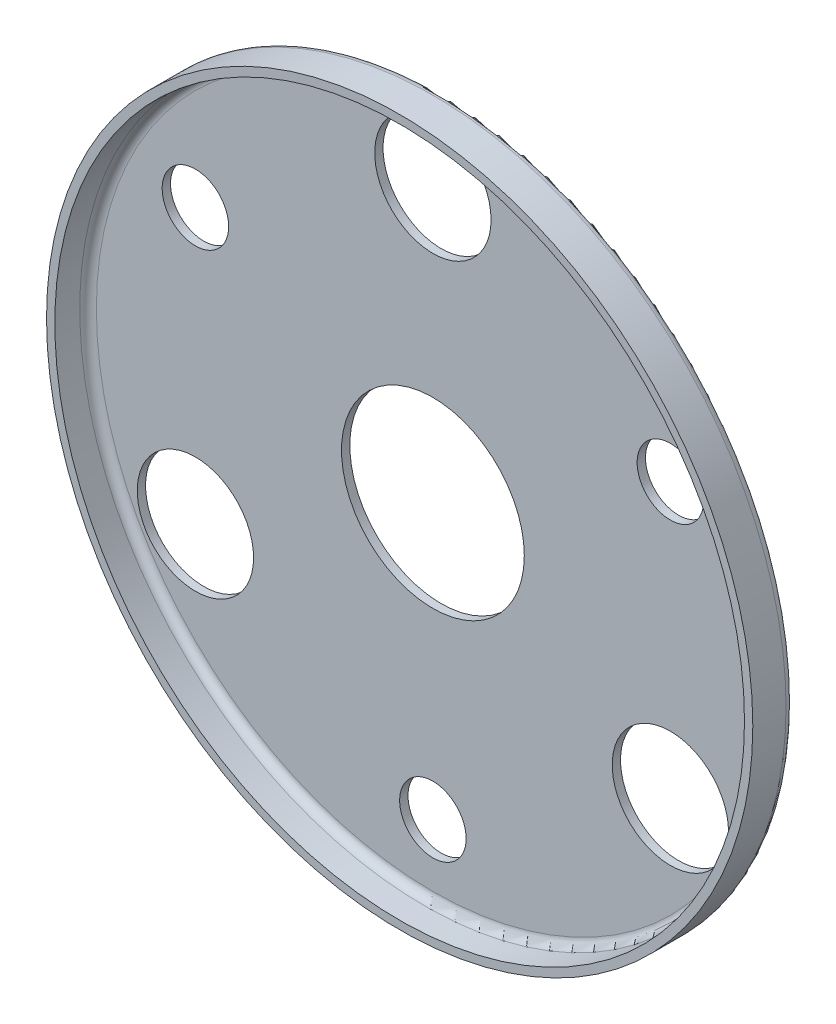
from build123d import *

# Parameters (mm, degrees)
ESQUISSE1_R                  = 42.5
EXTRUSION1_DEPTH             = 5
ESQUISSE2_R                  = 41.5
ENL_V_MAT_EXTRU_1_DEPTH      = 4
CONG_1_R                     = 1
ESQUISSE3_R                  = 11
ESQUISSE3_R_2                = 7
ENL_V_MAT_EXTRU_2_DEPTH      = 61.23703187
R_P_TITION_CIRCULAIRE1_COUNT = 3
ESQUISSE4_R                  = 4
ENL_V_MAT_EXTRU_3_DEPTH      = 61.23703187
R_P_TITION_CIRCULAIRE2_COUNT = 3


with BuildPart() as part:
    # Esquisse1 → Extrusion1 (new body)
    with BuildSketch(Plane.XY):
        Circle(ESQUISSE1_R)
    extrude(amount=EXTRUSION1_DEPTH)

    # Esquisse2 → Enl_v. mat.-Extru.1 (cut)
    with BuildSketch(Plane.XY.offset(5)):
        Circle(ESQUISSE2_R)
    extrude(amount=-ENL_V_MAT_EXTRU_1_DEPTH, mode=Mode.SUBTRACT)

    # Cong_1
    cong_1_edges = [part.edges().sort_by_distance(p)[0] for p in [
        (-42.5, 0, 0),
        (-41.5, 0, 1),
    ]]
    fillet(cong_1_edges, radius=CONG_1_R)

    # Esquisse3 → Enl_v. mat.-Extru.2 (cut, through all)
    with BuildSketch(Plane.XY.offset(1)):
        Circle(ESQUISSE3_R)
        with Locations((0, 33)):
            Circle(ESQUISSE3_R_2)
    enl_v_mat_extru_2 = extrude(amount=-ENL_V_MAT_EXTRU_2_DEPTH, mode=Mode.SUBTRACT)

    # R_p_tition circulaire1: Enl_v. mat.-Extru.2 ×3 about axis
    r_p_tition_circulaire1_axis = Axis((0, 0, 0), (0, 0, 1))
    for i in range(1, R_P_TITION_CIRCULAIRE1_COUNT):
        add(enl_v_mat_extru_2.rotate(r_p_tition_circulaire1_axis, i * 360 / R_P_TITION_CIRCULAIRE1_COUNT), mode=Mode.SUBTRACT)

    # Esquisse4 → Enl_v. mat.-Extru.3 (cut, through all)
    with BuildSketch(Plane.XY.offset(1)):
        with Locations((0, -33)):
            Circle(ESQUISSE4_R)
    enl_v_mat_extru_3 = extrude(amount=-ENL_V_MAT_EXTRU_3_DEPTH, mode=Mode.SUBTRACT)

    # R_p_tition circulaire2: Enl_v. mat.-Extru.3 ×3 about axis
    r_p_tition_circulaire2_axis = Axis((0, 0, 0), (0, 0, 1))
    for i in range(1, R_P_TITION_CIRCULAIRE2_COUNT):
        add(enl_v_mat_extru_3.rotate(r_p_tition_circulaire2_axis, i * 360 / R_P_TITION_CIRCULAIRE2_COUNT), mode=Mode.SUBTRACT)


solid = part.part
